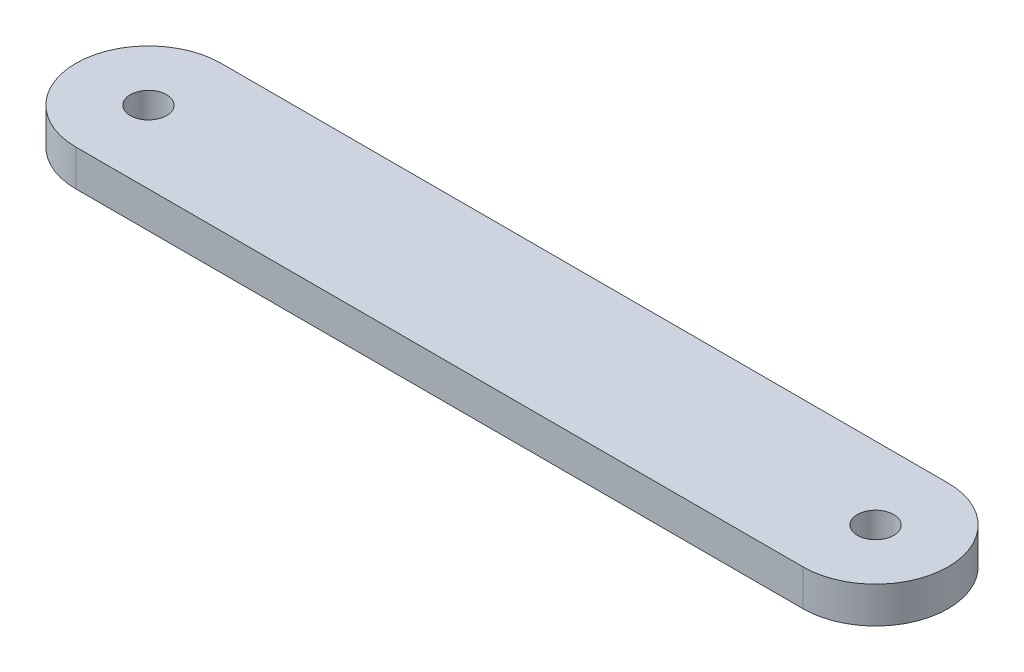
from build123d import *

# Parameters (mm, degrees)
SKETCH1_R           = 12.7
SKETCH1_R_2         = 3.175
BOSS_EXTRUDE1_DEPTH = 6.35


with BuildPart() as part:
    # Sketch1 → Boss-Extrude1 (new body)
    # profile 1 of 3: a face of its own
    with BuildSketch(Plane(origin=(0, 0, 0), x_dir=(1, 0, 0), z_dir=(0, 1, 0))):
        Circle(SKETCH1_R)
        with Locations(Location((0, 0, 0), (0, 0, 270))):
            Circle(SKETCH1_R_2, mode=Mode.SUBTRACT)
    # profile 2 of 3: a face of its own
    with BuildSketch(Plane(origin=(0, 0, 0), x_dir=(1, 0, 0), z_dir=(0, 1, 0))):
        with BuildLine():
            Line((127.254, 12.7), (0, 12.7))
            ThreePointArc((0, 12.7), (8.980256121, 8.980256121), (12.7, 0))
            ThreePointArc((12.7, 0), (8.980256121, -8.980256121), (0, -12.7))
            Line((0, -12.7), (127.254, -12.7))
            ThreePointArc((127.254, -12.7), (114.554, 0), (127.254, 12.7))
        make_face()
    # profile 3 of 3: a face of its own
    with BuildSketch(Plane(origin=(0, 0, 0), x_dir=(1, 0, 0), z_dir=(0, 1, 0))):
        with Locations((127.254, 0)):
            Circle(SKETCH1_R)
        with Locations(Location((127.254, 0, 0), (0, 0, 270))):
            Circle(SKETCH1_R_2, mode=Mode.SUBTRACT)
    extrude(amount=BOSS_EXTRUDE1_DEPTH)


solid = part.part
